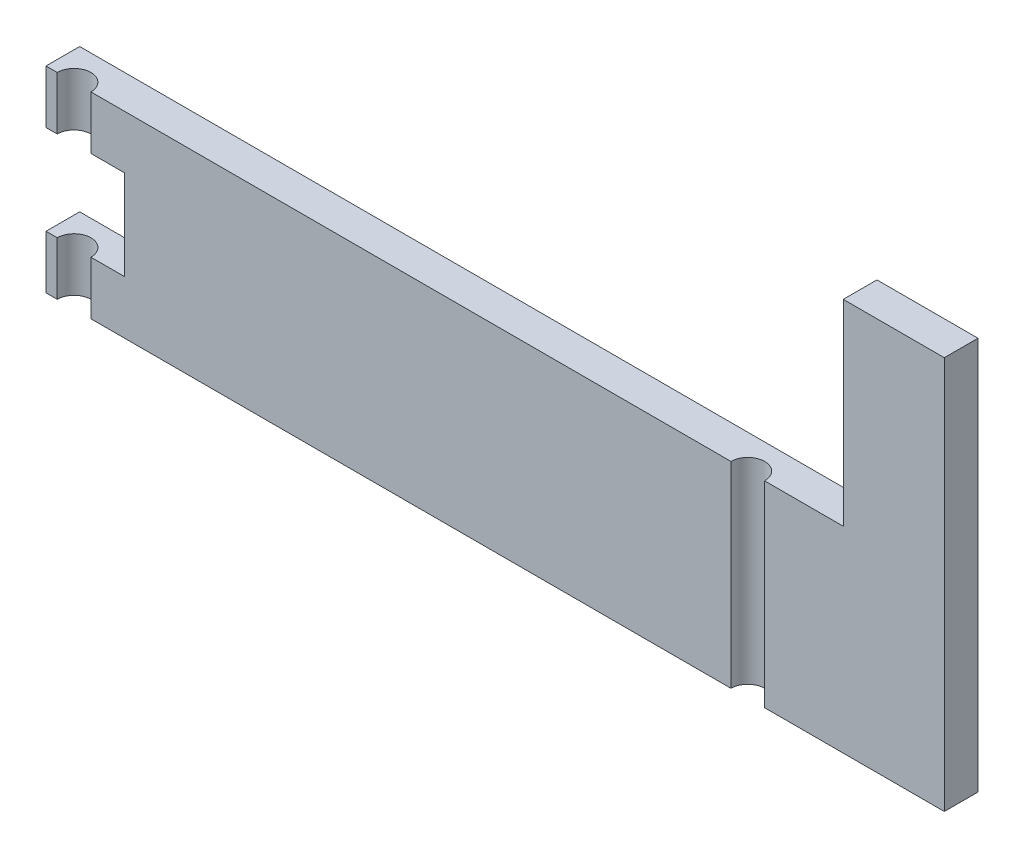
from build123d import *

# Parameters (mm, degrees)
EXTRUSION1_DEPTH        = 6
ESQUISSE2_R             = 3
ENL_V_MAT_EXTRU_1_DEPTH = 171.179317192


with BuildPart() as part:
    # Esquisse1 → Extrusion1 (new body)
    with BuildSketch(Plane.XY):
        Polygon((155, 70), (137, 70), (137, 35), (-5, 35), (-5, 25.5), (9, 25.5), (9, 9.5), (-5, 9.5), (-5, 0), (155, 0), align=None)
    extrude(amount=EXTRUSION1_DEPTH)

    # Esquisse2 → Enl_v. mat.-Extru.1 (cut, through all)
    with BuildSketch(Plane.XZ):
        with Locations((0, 6)):
            Circle(ESQUISSE2_R)
        with Locations((120, 6)):
            Circle(ESQUISSE2_R)
    extrude(amount=-ENL_V_MAT_EXTRU_1_DEPTH, mode=Mode.SUBTRACT)


solid = part.part
